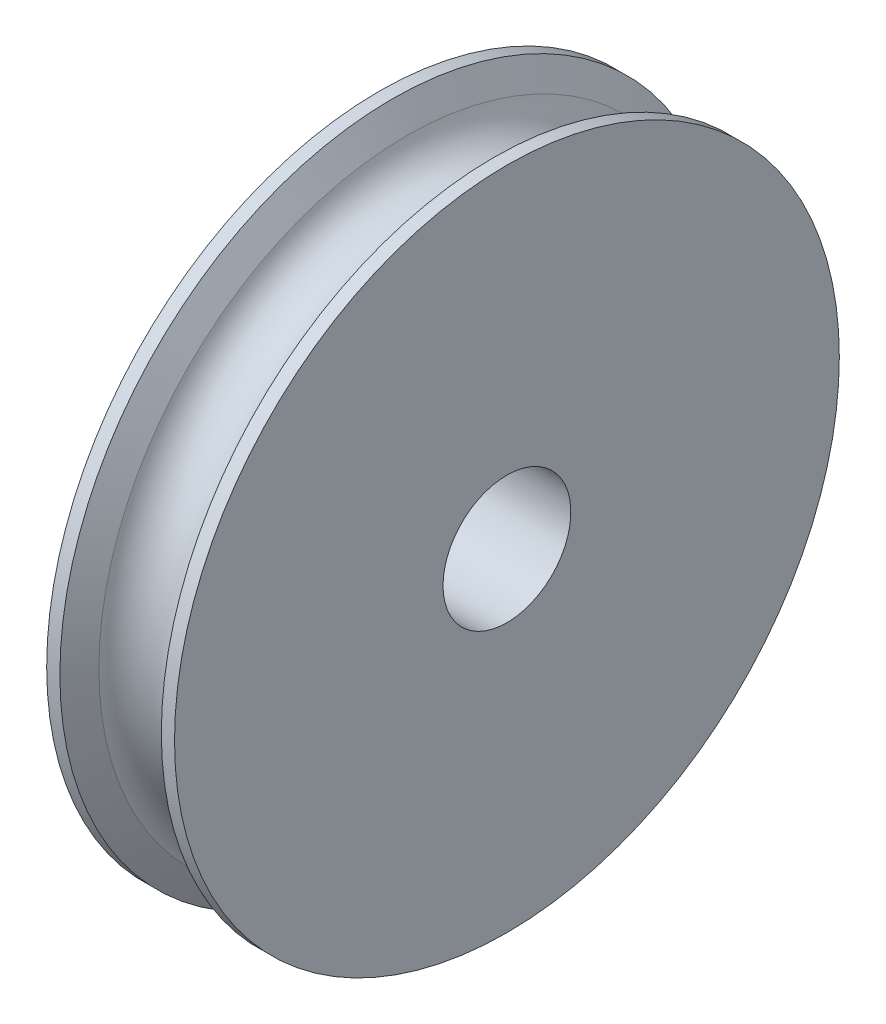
ISO-10303-21;
HEADER;
FILE_DESCRIPTION(('STEP AP214'),'2;1');
FILE_NAME('part.step','',(''),(''),'','','');
FILE_SCHEMA(('AUTOMOTIVE_DESIGN { 1 0 10303 214 1 1 1 1 }'));
ENDSEC;
DATA;
#1=APPLICATION_CONTEXT('core data for automotive mechanical design processes');
#2=APPLICATION_PROTOCOL_DEFINITION('international standard','automotive_design',2000,#1);
#3=PRODUCT_CONTEXT('',#1,'mechanical');
#4=PRODUCT('Part','Part','',(#3));
#5=PRODUCT_RELATED_PRODUCT_CATEGORY('part','',(#4));
#6=PRODUCT_DEFINITION_FORMATION('','',#4);
#7=PRODUCT_DEFINITION_CONTEXT('part definition',#1,'design');
#8=PRODUCT_DEFINITION('design','',#6,#7);
#9=PRODUCT_DEFINITION_SHAPE('','',#8);
#10=(LENGTH_UNIT() NAMED_UNIT(*) SI_UNIT(.MILLI.,.METRE.));
#11=(NAMED_UNIT(*) PLANE_ANGLE_UNIT() SI_UNIT($,.RADIAN.));
#12=(NAMED_UNIT(*) SI_UNIT($,.STERADIAN.) SOLID_ANGLE_UNIT());
#13=UNCERTAINTY_MEASURE_WITH_UNIT(LENGTH_MEASURE(1.E-05),#10,'distance_accuracy_value','');
#14=(GEOMETRIC_REPRESENTATION_CONTEXT(3) GLOBAL_UNCERTAINTY_ASSIGNED_CONTEXT((#13)) GLOBAL_UNIT_ASSIGNED_CONTEXT((#10,
#11,#12)) REPRESENTATION_CONTEXT('',''));
#15=CARTESIAN_POINT('',(0.,0.,0.));
#16=DIRECTION('',(0.,0.,1.));
#17=DIRECTION('',(1.,0.,0.));
#18=AXIS2_PLACEMENT_3D('',#15,#16,#17);
#19=CARTESIAN_POINT('',(3.96811878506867,0.,0.));
#20=DIRECTION('',(1.,0.,0.));
#21=DIRECTION('',(0.,1.,0.));
#22=AXIS2_PLACEMENT_3D('',#19,#20,#21);
#23=CONICAL_SURFACE('',#22,26.,1.0471975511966);
#24=CARTESIAN_POINT('',(3.96811878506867,0.,0.));
#25=DIRECTION('',(-1.,0.,0.));
#26=DIRECTION('',(0.,0.,1.));
#27=AXIS2_PLACEMENT_3D('',#24,#25,#26);
#28=CIRCLE('',#27,26.);
#29=CARTESIAN_POINT('',(3.96811878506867,0.,26.));
#30=VERTEX_POINT('',#29);
#31=EDGE_CURVE('E145',#30,#30,#28,.F.);
#32=ORIENTED_EDGE('',*,*,#31,.F.);
#33=EDGE_LOOP('',(#32));
#34=FACE_BOUND('',#33,.T.);
#35=CARTESIAN_POINT('',(2.85008479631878,0.,0.));
#36=DIRECTION('',(1.,0.,0.));
#37=DIRECTION('',(0.,0.,-1.));
#38=AXIS2_PLACEMENT_3D('',#35,#36,#37);
#39=CIRCLE('',#38,24.0635083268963);
#40=CARTESIAN_POINT('',(2.85008479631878,0.,-24.0635083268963));
#41=VERTEX_POINT('',#40);
#42=EDGE_CURVE('E43',#41,#41,#39,.T.);
#43=ORIENTED_EDGE('',*,*,#42,.T.);
#44=EDGE_LOOP('',(#43));
#45=FACE_BOUND('',#44,.T.);
#46=ADVANCED_FACE('F14',(#34,#45),#23,.T.);
#47=CARTESIAN_POINT('',(5.,0.,0.));
#48=DIRECTION('',(-1.,0.,0.));
#49=DIRECTION('',(0.,0.,1.));
#50=AXIS2_PLACEMENT_3D('',#47,#48,#49);
#51=CYLINDRICAL_SURFACE('',#50,26.);
#52=CARTESIAN_POINT('',(5.,0.,0.));
#53=DIRECTION('',(-1.,0.,0.));
#54=DIRECTION('',(0.,0.,1.));
#55=AXIS2_PLACEMENT_3D('',#52,#53,#54);
#56=CIRCLE('',#55,26.);
#57=CARTESIAN_POINT('',(5.,0.,26.));
#58=VERTEX_POINT('',#57);
#59=EDGE_CURVE('E17',#58,#58,#56,.F.);
#60=ORIENTED_EDGE('',*,*,#59,.F.);
#61=EDGE_LOOP('',(#60));
#62=FACE_BOUND('',#61,.T.);
#63=ORIENTED_EDGE('',*,*,#31,.T.);
#64=EDGE_LOOP('',(#63));
#65=FACE_BOUND('',#64,.T.);
#66=ADVANCED_FACE('F57',(#62,#65),#51,.T.);
#67=CARTESIAN_POINT('',(0.,0.,0.));
#68=DIRECTION('',(1.,0.,0.));
#69=DIRECTION('',(0.,0.,-1.));
#70=AXIS2_PLACEMENT_3D('',#67,#68,#69);
#71=TOROIDAL_SURFACE('',#70,25.,3.);
#72=CARTESIAN_POINT('',(-2.85008479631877,0.,0.));
#73=DIRECTION('',(-1.,0.,0.));
#74=DIRECTION('',(0.,0.,1.));
#75=AXIS2_PLACEMENT_3D('',#72,#73,#74);
#76=CIRCLE('',#75,24.0635083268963);
#77=CARTESIAN_POINT('',(-2.85008479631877,0.,24.0635083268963));
#78=VERTEX_POINT('',#77);
#79=EDGE_CURVE('E33',#78,#78,#76,.T.);
#80=ORIENTED_EDGE('',*,*,#79,.F.);
#81=EDGE_LOOP('',(#80));
#82=FACE_BOUND('',#81,.T.);
#83=ORIENTED_EDGE('',*,*,#42,.F.);
#84=EDGE_LOOP('',(#83));
#85=FACE_BOUND('',#84,.T.);
#86=ADVANCED_FACE('F53',(#82,#85),#71,.F.);
#87=CARTESIAN_POINT('',(5.,5.,0.));
#88=DIRECTION('',(1.,0.,0.));
#89=DIRECTION('',(0.,0.,-1.));
#90=AXIS2_PLACEMENT_3D('',#87,#88,#89);
#91=PLANE('',#90);
#92=CARTESIAN_POINT('',(5.,0.,0.));
#93=DIRECTION('',(-1.,0.,0.));
#94=DIRECTION('',(0.,0.,1.));
#95=AXIS2_PLACEMENT_3D('',#92,#93,#94);
#96=CIRCLE('',#95,5.);
#97=CARTESIAN_POINT('',(5.,0.,5.));
#98=VERTEX_POINT('',#97);
#99=EDGE_CURVE('E31',#98,#98,#96,.T.);
#100=ORIENTED_EDGE('',*,*,#99,.T.);
#101=EDGE_LOOP('',(#100));
#102=FACE_BOUND('',#101,.T.);
#103=ORIENTED_EDGE('',*,*,#59,.T.);
#104=EDGE_LOOP('',(#103));
#105=FACE_BOUND('',#104,.T.);
#106=ADVANCED_FACE('F56',(#102,#105),#91,.T.);
#107=CARTESIAN_POINT('',(-3.96811878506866,0.,0.));
#108=DIRECTION('',(-1.,0.,0.));
#109=DIRECTION('',(0.,0.,1.));
#110=AXIS2_PLACEMENT_3D('',#107,#108,#109);
#111=CONICAL_SURFACE('',#110,26.,1.0471975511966);
#112=ORIENTED_EDGE('',*,*,#79,.T.);
#113=EDGE_LOOP('',(#112));
#114=FACE_BOUND('',#113,.T.);
#115=CARTESIAN_POINT('',(-3.96811878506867,0.,0.));
#116=DIRECTION('',(-1.,0.,0.));
#117=DIRECTION('',(0.,0.,1.));
#118=AXIS2_PLACEMENT_3D('',#115,#116,#117);
#119=CIRCLE('',#118,26.);
#120=CARTESIAN_POINT('',(-3.96811878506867,0.,26.));
#121=VERTEX_POINT('',#120);
#122=EDGE_CURVE('E26',#121,#121,#119,.T.);
#123=ORIENTED_EDGE('',*,*,#122,.F.);
#124=EDGE_LOOP('',(#123));
#125=FACE_BOUND('',#124,.T.);
#126=ADVANCED_FACE('F82',(#114,#125),#111,.T.);
#127=CARTESIAN_POINT('',(5.,0.,0.));
#128=DIRECTION('',(-1.,0.,0.));
#129=DIRECTION('',(0.,0.,1.));
#130=AXIS2_PLACEMENT_3D('',#127,#128,#129);
#131=CYLINDRICAL_SURFACE('',#130,5.);
#132=CARTESIAN_POINT('',(-5.,0.,0.));
#133=DIRECTION('',(-1.,0.,0.));
#134=DIRECTION('',(0.,0.,1.));
#135=AXIS2_PLACEMENT_3D('',#132,#133,#134);
#136=CIRCLE('',#135,5.);
#137=CARTESIAN_POINT('',(-5.,0.,5.));
#138=VERTEX_POINT('',#137);
#139=EDGE_CURVE('E21',#138,#138,#136,.F.);
#140=ORIENTED_EDGE('',*,*,#139,.F.);
#141=EDGE_LOOP('',(#140));
#142=FACE_BOUND('',#141,.T.);
#143=ORIENTED_EDGE('',*,*,#99,.F.);
#144=EDGE_LOOP('',(#143));
#145=FACE_BOUND('',#144,.T.);
#146=ADVANCED_FACE('F76',(#142,#145),#131,.F.);
#147=CARTESIAN_POINT('',(5.,0.,0.));
#148=DIRECTION('',(-1.,0.,0.));
#149=DIRECTION('',(0.,0.,1.));
#150=AXIS2_PLACEMENT_3D('',#147,#148,#149);
#151=CYLINDRICAL_SURFACE('',#150,26.);
#152=ORIENTED_EDGE('',*,*,#122,.T.);
#153=EDGE_LOOP('',(#152));
#154=FACE_BOUND('',#153,.T.);
#155=CARTESIAN_POINT('',(-5.,0.,0.));
#156=DIRECTION('',(-1.,0.,0.));
#157=DIRECTION('',(0.,0.,1.));
#158=AXIS2_PLACEMENT_3D('',#155,#156,#157);
#159=CIRCLE('',#158,26.);
#160=CARTESIAN_POINT('',(-5.,0.,26.));
#161=VERTEX_POINT('',#160);
#162=EDGE_CURVE('E10',#161,#161,#159,.T.);
#163=ORIENTED_EDGE('',*,*,#162,.F.);
#164=EDGE_LOOP('',(#163));
#165=FACE_BOUND('',#164,.T.);
#166=ADVANCED_FACE('F71',(#154,#165),#151,.T.);
#167=CARTESIAN_POINT('',(-5.,26.,0.));
#168=DIRECTION('',(-1.,0.,0.));
#169=DIRECTION('',(0.,0.,1.));
#170=AXIS2_PLACEMENT_3D('',#167,#168,#169);
#171=PLANE('',#170);
#172=ORIENTED_EDGE('',*,*,#162,.T.);
#173=EDGE_LOOP('',(#172));
#174=FACE_BOUND('',#173,.T.);
#175=ORIENTED_EDGE('',*,*,#139,.T.);
#176=EDGE_LOOP('',(#175));
#177=FACE_BOUND('',#176,.T.);
#178=ADVANCED_FACE('F69',(#174,#177),#171,.T.);
#179=CLOSED_SHELL('',(#46,#66,#86,#106,#126,#146,#166,#178));
#180=MANIFOLD_SOLID_BREP('B1',#179);
#181=ADVANCED_BREP_SHAPE_REPRESENTATION('',(#18,#180),#14);
#182=SHAPE_DEFINITION_REPRESENTATION(#9,#181);
ENDSEC;
END-ISO-10303-21;
